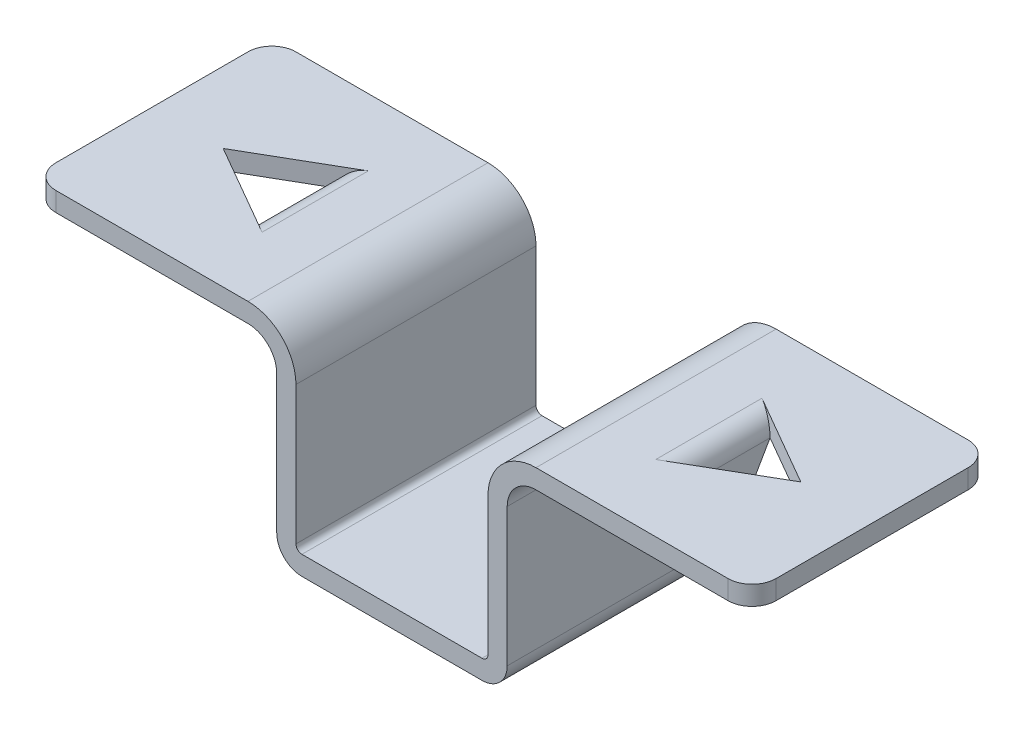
ISO-10303-21;
HEADER;
FILE_DESCRIPTION(('STEP AP214'),'2;1');
FILE_NAME('part.step','',(''),(''),'','','');
FILE_SCHEMA(('AUTOMOTIVE_DESIGN { 1 0 10303 214 1 1 1 1 }'));
ENDSEC;
DATA;
#1=APPLICATION_CONTEXT('core data for automotive mechanical design processes');
#2=APPLICATION_PROTOCOL_DEFINITION('international standard','automotive_design',2000,#1);
#3=PRODUCT_CONTEXT('',#1,'mechanical');
#4=PRODUCT('Part','Part','',(#3));
#5=PRODUCT_RELATED_PRODUCT_CATEGORY('part','',(#4));
#6=PRODUCT_DEFINITION_FORMATION('','',#4);
#7=PRODUCT_DEFINITION_CONTEXT('part definition',#1,'design');
#8=PRODUCT_DEFINITION('design','',#6,#7);
#9=PRODUCT_DEFINITION_SHAPE('','',#8);
#10=(LENGTH_UNIT() NAMED_UNIT(*) SI_UNIT(.MILLI.,.METRE.));
#11=(NAMED_UNIT(*) PLANE_ANGLE_UNIT() SI_UNIT($,.RADIAN.));
#12=(NAMED_UNIT(*) SI_UNIT($,.STERADIAN.) SOLID_ANGLE_UNIT());
#13=UNCERTAINTY_MEASURE_WITH_UNIT(LENGTH_MEASURE(1.E-05),#10,'distance_accuracy_value','');
#14=(GEOMETRIC_REPRESENTATION_CONTEXT(3) GLOBAL_UNCERTAINTY_ASSIGNED_CONTEXT((#13)) GLOBAL_UNIT_ASSIGNED_CONTEXT((#10,
#11,#12)) REPRESENTATION_CONTEXT('',''));
#15=CARTESIAN_POINT('',(0.,0.,0.));
#16=DIRECTION('',(0.,0.,1.));
#17=DIRECTION('',(1.,0.,0.));
#18=AXIS2_PLACEMENT_3D('',#15,#16,#17);
#19=CARTESIAN_POINT('',(6.00000000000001,-0.799999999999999,5.));
#20=DIRECTION('',(0.,1.,0.));
#21=DIRECTION('',(-1.,0.,0.));
#22=AXIS2_PLACEMENT_3D('',#19,#20,#21);
#23=PLANE('',#22);
#24=DIRECTION('',(0.,0.,-1.));
#25=VECTOR('',#24,1.);
#26=CARTESIAN_POINT('',(15.,-0.799999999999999,5.));
#27=LINE('',#26,#25);
#28=CARTESIAN_POINT('',(15.,-0.799999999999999,4.));
#29=VERTEX_POINT('',#28);
#30=CARTESIAN_POINT('',(15.,-0.799999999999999,-4.));
#31=VERTEX_POINT('',#30);
#32=EDGE_CURVE('E438',#29,#31,#27,.T.);
#33=ORIENTED_EDGE('',*,*,#32,.F.);
#34=CARTESIAN_POINT('',(14.,-0.799999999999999,4.));
#35=DIRECTION('',(0.,1.,0.));
#36=DIRECTION('',(-1.,0.,0.));
#37=AXIS2_PLACEMENT_3D('',#34,#35,#36);
#38=CIRCLE('',#37,1.);
#39=CARTESIAN_POINT('',(14.,-0.799999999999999,5.));
#40=VERTEX_POINT('',#39);
#41=EDGE_CURVE('E11',#29,#40,#38,.F.);
#42=ORIENTED_EDGE('',*,*,#41,.T.);
#43=DIRECTION('',(1.,0.,0.));
#44=VECTOR('',#43,1.);
#45=CARTESIAN_POINT('',(6.00000000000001,-0.799999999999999,5.));
#46=LINE('',#45,#44);
#47=CARTESIAN_POINT('',(6.00000000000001,-0.799999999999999,5.));
#48=VERTEX_POINT('',#47);
#49=EDGE_CURVE('E351',#48,#40,#46,.T.);
#50=ORIENTED_EDGE('',*,*,#49,.F.);
#51=DIRECTION('',(0.,0.,-1.));
#52=VECTOR('',#51,1.);
#53=CARTESIAN_POINT('',(6.00000000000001,-0.799999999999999,5.));
#54=LINE('',#53,#52);
#55=CARTESIAN_POINT('',(6.00000000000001,-0.799999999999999,-5.));
#56=VERTEX_POINT('',#55);
#57=EDGE_CURVE('E440',#48,#56,#54,.T.);
#58=ORIENTED_EDGE('',*,*,#57,.T.);
#59=DIRECTION('',(1.,0.,0.));
#60=VECTOR('',#59,1.);
#61=CARTESIAN_POINT('',(6.00000000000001,-0.799999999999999,-5.));
#62=LINE('',#61,#60);
#63=CARTESIAN_POINT('',(14.,-0.799999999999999,-5.));
#64=VERTEX_POINT('',#63);
#65=EDGE_CURVE('E389',#56,#64,#62,.T.);
#66=ORIENTED_EDGE('',*,*,#65,.T.);
#67=CARTESIAN_POINT('',(14.,-0.799999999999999,-4.));
#68=DIRECTION('',(0.,1.,0.));
#69=DIRECTION('',(-1.,0.,0.));
#70=AXIS2_PLACEMENT_3D('',#67,#68,#69);
#71=CIRCLE('',#70,1.);
#72=EDGE_CURVE('E40',#64,#31,#71,.F.);
#73=ORIENTED_EDGE('',*,*,#72,.T.);
#74=EDGE_LOOP('',(#33,#42,#50,#58,#66,#73));
#75=FACE_BOUND('',#74,.T.);
#76=DIRECTION('',(1.,0.,0.));
#77=VECTOR('',#76,1.);
#78=CARTESIAN_POINT('',(8.2,-0.8,-1.75));
#79=LINE('',#78,#77);
#80=CARTESIAN_POINT('',(8.2,-0.799999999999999,-1.75));
#81=VERTEX_POINT('',#80);
#82=CARTESIAN_POINT('',(9.,-0.799999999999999,-1.75));
#83=VERTEX_POINT('',#82);
#84=EDGE_CURVE('E273',#81,#83,#79,.T.);
#85=ORIENTED_EDGE('',*,*,#84,.F.);
#86=DIRECTION('',(0.,0.,-1.));
#87=VECTOR('',#86,1.);
#88=CARTESIAN_POINT('',(8.2,-0.8,1.75));
#89=LINE('',#88,#87);
#90=CARTESIAN_POINT('',(8.2,-0.799999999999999,1.75));
#91=VERTEX_POINT('',#90);
#92=EDGE_CURVE('E260',#91,#81,#89,.T.);
#93=ORIENTED_EDGE('',*,*,#92,.F.);
#94=DIRECTION('',(1.,0.,0.));
#95=VECTOR('',#94,1.);
#96=CARTESIAN_POINT('',(8.2,-0.8,1.75));
#97=LINE('',#96,#95);
#98=CARTESIAN_POINT('',(9.,-0.8,1.75));
#99=VERTEX_POINT('',#98);
#100=EDGE_CURVE('E263',#91,#99,#97,.T.);
#101=ORIENTED_EDGE('',*,*,#100,.T.);
#102=DIRECTION('',(0.866025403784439,0.,-0.5));
#103=VECTOR('',#102,1.);
#104=CARTESIAN_POINT('',(5.3427087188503,-0.799999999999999,3.86153810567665));
#105=LINE('',#104,#103);
#106=CARTESIAN_POINT('',(12.0310889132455,-0.799999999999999,0.));
#107=VERTEX_POINT('',#106);
#108=EDGE_CURVE('E317',#99,#107,#105,.T.);
#109=ORIENTED_EDGE('',*,*,#108,.T.);
#110=DIRECTION('',(-0.866025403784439,0.,-0.5));
#111=VECTOR('',#110,1.);
#112=CARTESIAN_POINT('',(9.67283573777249,-0.799999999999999,-1.36153810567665));
#113=LINE('',#112,#111);
#114=EDGE_CURVE('E314',#107,#83,#113,.T.);
#115=ORIENTED_EDGE('',*,*,#114,.T.);
#116=EDGE_LOOP('',(#85,#93,#101,#109,#115));
#117=FACE_BOUND('',#116,.T.);
#118=ADVANCED_FACE('F32',(#75,#117),#23,.F.);
#119=CARTESIAN_POINT('',(-15.,0.,5.));
#120=DIRECTION('',(1.,0.,0.));
#121=DIRECTION('',(0.,0.,-1.));
#122=AXIS2_PLACEMENT_3D('',#119,#120,#121);
#123=PLANE('',#122);
#124=DIRECTION('',(0.,0.,-1.));
#125=VECTOR('',#124,1.);
#126=CARTESIAN_POINT('',(-15.,-0.8,5.));
#127=LINE('',#126,#125);
#128=CARTESIAN_POINT('',(-15.,-0.8,4.));
#129=VERTEX_POINT('',#128);
#130=CARTESIAN_POINT('',(-15.,-0.8,-4.));
#131=VERTEX_POINT('',#130);
#132=EDGE_CURVE('E464',#129,#131,#127,.T.);
#133=ORIENTED_EDGE('',*,*,#132,.F.);
#134=DIRECTION('',(0.,-1.,0.));
#135=VECTOR('',#134,1.);
#136=CARTESIAN_POINT('',(-15.,0.,4.));
#137=LINE('',#136,#135);
#138=CARTESIAN_POINT('',(-15.,0.,4.));
#139=VERTEX_POINT('',#138);
#140=EDGE_CURVE('E502',#129,#139,#137,.F.);
#141=ORIENTED_EDGE('',*,*,#140,.T.);
#142=DIRECTION('',(0.,0.,-1.));
#143=VECTOR('',#142,1.);
#144=CARTESIAN_POINT('',(-15.,0.,5.));
#145=LINE('',#144,#143);
#146=CARTESIAN_POINT('',(-15.,0.,-4.));
#147=VERTEX_POINT('',#146);
#148=EDGE_CURVE('E373',#139,#147,#145,.T.);
#149=ORIENTED_EDGE('',*,*,#148,.T.);
#150=DIRECTION('',(0.,-1.,0.));
#151=VECTOR('',#150,1.);
#152=CARTESIAN_POINT('',(-15.,-0.8,-4.));
#153=LINE('',#152,#151);
#154=EDGE_CURVE('E499',#147,#131,#153,.T.);
#155=ORIENTED_EDGE('',*,*,#154,.T.);
#156=EDGE_LOOP('',(#133,#141,#149,#155));
#157=FACE_BOUND('',#156,.T.);
#158=ADVANCED_FACE('F552',(#157),#123,.F.);
#159=CARTESIAN_POINT('',(-15.,-0.8,5.));
#160=DIRECTION('',(0.,1.,0.));
#161=DIRECTION('',(0.,0.,1.));
#162=AXIS2_PLACEMENT_3D('',#159,#160,#161);
#163=PLANE('',#162);
#164=DIRECTION('',(0.866025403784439,0.,0.5));
#165=VECTOR('',#164,1.);
#166=CARTESIAN_POINT('',(-12.0927087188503,-0.8,-0.0355762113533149));
#167=LINE('',#166,#165);
#168=CARTESIAN_POINT('',(-12.0310889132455,-0.8,0.));
#169=VERTEX_POINT('',#168);
#170=CARTESIAN_POINT('',(-9.,-0.8,1.75));
#171=VERTEX_POINT('',#170);
#172=EDGE_CURVE('E327',#169,#171,#167,.T.);
#173=ORIENTED_EDGE('',*,*,#172,.T.);
#174=DIRECTION('',(-1.,0.,0.));
#175=VECTOR('',#174,1.);
#176=CARTESIAN_POINT('',(-8.2,-0.8,1.75));
#177=LINE('',#176,#175);
#178=CARTESIAN_POINT('',(-8.2,-0.8,1.75));
#179=VERTEX_POINT('',#178);
#180=EDGE_CURVE('E300',#179,#171,#177,.T.);
#181=ORIENTED_EDGE('',*,*,#180,.F.);
#182=DIRECTION('',(0.,0.,-1.));
#183=VECTOR('',#182,1.);
#184=CARTESIAN_POINT('',(-8.2,-0.8,1.75));
#185=LINE('',#184,#183);
#186=CARTESIAN_POINT('',(-8.2,-0.8,-1.75));
#187=VERTEX_POINT('',#186);
#188=EDGE_CURVE('E286',#179,#187,#185,.T.);
#189=ORIENTED_EDGE('',*,*,#188,.T.);
#190=DIRECTION('',(-1.,0.,0.));
#191=VECTOR('',#190,1.);
#192=CARTESIAN_POINT('',(-8.2,-0.8,-1.75));
#193=LINE('',#192,#191);
#194=CARTESIAN_POINT('',(-9.,-0.8,-1.75));
#195=VERTEX_POINT('',#194);
#196=EDGE_CURVE('E295',#187,#195,#193,.T.);
#197=ORIENTED_EDGE('',*,*,#196,.T.);
#198=DIRECTION('',(-0.866025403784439,0.,0.5));
#199=VECTOR('',#198,1.);
#200=CARTESIAN_POINT('',(-16.4228357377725,-0.8,2.53557621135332));
#201=LINE('',#200,#199);
#202=EDGE_CURVE('E330',#195,#169,#201,.T.);
#203=ORIENTED_EDGE('',*,*,#202,.T.);
#204=EDGE_LOOP('',(#173,#181,#189,#197,#203));
#205=FACE_BOUND('',#204,.T.);
#206=DIRECTION('',(1.,0.,0.));
#207=VECTOR('',#206,1.);
#208=CARTESIAN_POINT('',(-15.,-0.8,5.));
#209=LINE('',#208,#207);
#210=CARTESIAN_POINT('',(-14.,-0.8,5.));
#211=VERTEX_POINT('',#210);
#212=CARTESIAN_POINT('',(-6.00000000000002,-0.8,5.));
#213=VERTEX_POINT('',#212);
#214=EDGE_CURVE('E334',#211,#213,#209,.T.);
#215=ORIENTED_EDGE('',*,*,#214,.F.);
#216=CARTESIAN_POINT('',(-14.,-0.8,4.));
#217=DIRECTION('',(0.,1.,0.));
#218=DIRECTION('',(0.,0.,1.));
#219=AXIS2_PLACEMENT_3D('',#216,#217,#218);
#220=CIRCLE('',#219,1.);
#221=EDGE_CURVE('E497',#211,#129,#220,.F.);
#222=ORIENTED_EDGE('',*,*,#221,.T.);
#223=ORIENTED_EDGE('',*,*,#132,.T.);
#224=CARTESIAN_POINT('',(-14.,-0.8,-4.));
#225=DIRECTION('',(0.,1.,0.));
#226=DIRECTION('',(0.,0.,1.));
#227=AXIS2_PLACEMENT_3D('',#224,#225,#226);
#228=CIRCLE('',#227,1.);
#229=CARTESIAN_POINT('',(-14.,-0.8,-5.));
#230=VERTEX_POINT('',#229);
#231=EDGE_CURVE('E495',#131,#230,#228,.F.);
#232=ORIENTED_EDGE('',*,*,#231,.T.);
#233=DIRECTION('',(1.,0.,0.));
#234=VECTOR('',#233,1.);
#235=CARTESIAN_POINT('',(-15.,-0.8,-5.));
#236=LINE('',#235,#234);
#237=CARTESIAN_POINT('',(-6.00000000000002,-0.8,-5.));
#238=VERTEX_POINT('',#237);
#239=EDGE_CURVE('E333',#230,#238,#236,.T.);
#240=ORIENTED_EDGE('',*,*,#239,.T.);
#241=DIRECTION('',(0.,0.,-1.));
#242=VECTOR('',#241,1.);
#243=CARTESIAN_POINT('',(-6.00000000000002,-0.8,5.));
#244=LINE('',#243,#242);
#245=EDGE_CURVE('E461',#213,#238,#244,.T.);
#246=ORIENTED_EDGE('',*,*,#245,.F.);
#247=EDGE_LOOP('',(#215,#222,#223,#232,#240,#246));
#248=FACE_BOUND('',#247,.T.);
#249=ADVANCED_FACE('F557',(#205,#248),#163,.F.);
#250=CARTESIAN_POINT('',(-6.,-2.,5.));
#251=DIRECTION('',(0.,0.,-1.));
#252=DIRECTION('',(-1.,0.,0.));
#253=AXIS2_PLACEMENT_3D('',#250,#251,#252);
#254=CYLINDRICAL_SURFACE('',#253,1.2);
#255=CARTESIAN_POINT('',(-6.,-2.,-5.));
#256=DIRECTION('',(0.,0.,-1.));
#257=DIRECTION('',(-1.,0.,0.));
#258=AXIS2_PLACEMENT_3D('',#255,#256,#257);
#259=CIRCLE('',#258,1.2);
#260=CARTESIAN_POINT('',(-4.8,-2.00000000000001,-5.));
#261=VERTEX_POINT('',#260);
#262=EDGE_CURVE('E375',#238,#261,#259,.T.);
#263=ORIENTED_EDGE('',*,*,#262,.T.);
#264=DIRECTION('',(0.,0.,-1.));
#265=VECTOR('',#264,1.);
#266=CARTESIAN_POINT('',(-4.8,-2.00000000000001,5.));
#267=LINE('',#266,#265);
#268=CARTESIAN_POINT('',(-4.8,-2.00000000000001,5.));
#269=VERTEX_POINT('',#268);
#270=EDGE_CURVE('E458',#269,#261,#267,.T.);
#271=ORIENTED_EDGE('',*,*,#270,.F.);
#272=CARTESIAN_POINT('',(-6.,-2.,5.));
#273=DIRECTION('',(0.,0.,-1.));
#274=DIRECTION('',(-1.,0.,0.));
#275=AXIS2_PLACEMENT_3D('',#272,#273,#274);
#276=CIRCLE('',#275,1.2);
#277=EDGE_CURVE('E336',#213,#269,#276,.T.);
#278=ORIENTED_EDGE('',*,*,#277,.F.);
#279=ORIENTED_EDGE('',*,*,#245,.T.);
#280=EDGE_LOOP('',(#263,#271,#278,#279));
#281=FACE_BOUND('',#280,.T.);
#282=ADVANCED_FACE('F585',(#281),#254,.F.);
#283=CARTESIAN_POINT('',(-4.8,-2.00000000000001,5.));
#284=DIRECTION('',(1.,0.,0.));
#285=DIRECTION('',(0.,1.,0.));
#286=AXIS2_PLACEMENT_3D('',#283,#284,#285);
#287=PLANE('',#286);
#288=DIRECTION('',(0.,-1.,0.));
#289=VECTOR('',#288,1.);
#290=CARTESIAN_POINT('',(-4.8,-2.00000000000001,-5.));
#291=LINE('',#290,#289);
#292=CARTESIAN_POINT('',(-4.8,-7.75,-5.));
#293=VERTEX_POINT('',#292);
#294=EDGE_CURVE('E377',#261,#293,#291,.T.);
#295=ORIENTED_EDGE('',*,*,#294,.T.);
#296=DIRECTION('',(0.,0.,-1.));
#297=VECTOR('',#296,1.);
#298=CARTESIAN_POINT('',(-4.8,-7.75,5.));
#299=LINE('',#298,#297);
#300=CARTESIAN_POINT('',(-4.8,-7.75,5.));
#301=VERTEX_POINT('',#300);
#302=EDGE_CURVE('E455',#301,#293,#299,.T.);
#303=ORIENTED_EDGE('',*,*,#302,.F.);
#304=DIRECTION('',(0.,-1.,0.));
#305=VECTOR('',#304,1.);
#306=CARTESIAN_POINT('',(-4.8,-2.00000000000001,5.));
#307=LINE('',#306,#305);
#308=EDGE_CURVE('E339',#269,#301,#307,.T.);
#309=ORIENTED_EDGE('',*,*,#308,.F.);
#310=ORIENTED_EDGE('',*,*,#270,.T.);
#311=EDGE_LOOP('',(#295,#303,#309,#310));
#312=FACE_BOUND('',#311,.T.);
#313=ADVANCED_FACE('F581',(#312),#287,.F.);
#314=CARTESIAN_POINT('',(-3.75,-7.75,5.));
#315=DIRECTION('',(0.,0.,-1.));
#316=DIRECTION('',(-1.,0.,0.));
#317=AXIS2_PLACEMENT_3D('',#314,#315,#316);
#318=CYLINDRICAL_SURFACE('',#317,1.05);
#319=CARTESIAN_POINT('',(-3.75,-7.75,-5.));
#320=DIRECTION('',(0.,0.,1.));
#321=DIRECTION('',(1.,0.,0.));
#322=AXIS2_PLACEMENT_3D('',#319,#320,#321);
#323=CIRCLE('',#322,1.05);
#324=CARTESIAN_POINT('',(-3.74999999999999,-8.8,-5.));
#325=VERTEX_POINT('',#324);
#326=EDGE_CURVE('E379',#293,#325,#323,.T.);
#327=ORIENTED_EDGE('',*,*,#326,.T.);
#328=DIRECTION('',(0.,0.,-1.));
#329=VECTOR('',#328,1.);
#330=CARTESIAN_POINT('',(-3.74999999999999,-8.8,5.));
#331=LINE('',#330,#329);
#332=CARTESIAN_POINT('',(-3.74999999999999,-8.8,5.));
#333=VERTEX_POINT('',#332);
#334=EDGE_CURVE('E452',#333,#325,#331,.T.);
#335=ORIENTED_EDGE('',*,*,#334,.F.);
#336=CARTESIAN_POINT('',(-3.75,-7.75,5.));
#337=DIRECTION('',(0.,0.,1.));
#338=DIRECTION('',(1.,0.,0.));
#339=AXIS2_PLACEMENT_3D('',#336,#337,#338);
#340=CIRCLE('',#339,1.05);
#341=EDGE_CURVE('E341',#301,#333,#340,.T.);
#342=ORIENTED_EDGE('',*,*,#341,.F.);
#343=ORIENTED_EDGE('',*,*,#302,.T.);
#344=EDGE_LOOP('',(#327,#335,#342,#343));
#345=FACE_BOUND('',#344,.T.);
#346=ADVANCED_FACE('F577',(#345),#318,.T.);
#347=CARTESIAN_POINT('',(-3.74999999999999,-8.8,5.));
#348=DIRECTION('',(0.,1.,0.));
#349=DIRECTION('',(0.,0.,1.));
#350=AXIS2_PLACEMENT_3D('',#347,#348,#349);
#351=PLANE('',#350);
#352=DIRECTION('',(1.,0.,0.));
#353=VECTOR('',#352,1.);
#354=CARTESIAN_POINT('',(-3.74999999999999,-8.8,-5.));
#355=LINE('',#354,#353);
#356=CARTESIAN_POINT('',(3.75,-8.8,-5.));
#357=VERTEX_POINT('',#356);
#358=EDGE_CURVE('E381',#325,#357,#355,.T.);
#359=ORIENTED_EDGE('',*,*,#358,.T.);
#360=DIRECTION('',(0.,0.,-1.));
#361=VECTOR('',#360,1.);
#362=CARTESIAN_POINT('',(3.75,-8.8,5.));
#363=LINE('',#362,#361);
#364=CARTESIAN_POINT('',(3.75,-8.8,5.));
#365=VERTEX_POINT('',#364);
#366=EDGE_CURVE('E449',#365,#357,#363,.T.);
#367=ORIENTED_EDGE('',*,*,#366,.F.);
#368=DIRECTION('',(1.,0.,0.));
#369=VECTOR('',#368,1.);
#370=CARTESIAN_POINT('',(-3.74999999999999,-8.8,5.));
#371=LINE('',#370,#369);
#372=EDGE_CURVE('E343',#333,#365,#371,.T.);
#373=ORIENTED_EDGE('',*,*,#372,.F.);
#374=ORIENTED_EDGE('',*,*,#334,.T.);
#375=EDGE_LOOP('',(#359,#367,#373,#374));
#376=FACE_BOUND('',#375,.T.);
#377=ADVANCED_FACE('F573',(#376),#351,.F.);
#378=CARTESIAN_POINT('',(3.75,-7.75,5.));
#379=DIRECTION('',(0.,0.,-1.));
#380=DIRECTION('',(-1.,0.,0.));
#381=AXIS2_PLACEMENT_3D('',#378,#379,#380);
#382=CYLINDRICAL_SURFACE('',#381,1.05);
#383=CARTESIAN_POINT('',(3.75,-7.75,-5.));
#384=DIRECTION('',(0.,0.,1.));
#385=DIRECTION('',(1.,0.,0.));
#386=AXIS2_PLACEMENT_3D('',#383,#384,#385);
#387=CIRCLE('',#386,1.05);
#388=CARTESIAN_POINT('',(4.8,-7.74999999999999,-5.));
#389=VERTEX_POINT('',#388);
#390=EDGE_CURVE('E383',#357,#389,#387,.T.);
#391=ORIENTED_EDGE('',*,*,#390,.T.);
#392=DIRECTION('',(0.,0.,-1.));
#393=VECTOR('',#392,1.);
#394=CARTESIAN_POINT('',(4.8,-7.74999999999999,5.));
#395=LINE('',#394,#393);
#396=CARTESIAN_POINT('',(4.8,-7.74999999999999,5.));
#397=VERTEX_POINT('',#396);
#398=EDGE_CURVE('E446',#397,#389,#395,.T.);
#399=ORIENTED_EDGE('',*,*,#398,.F.);
#400=CARTESIAN_POINT('',(3.75,-7.75,5.));
#401=DIRECTION('',(0.,0.,1.));
#402=DIRECTION('',(1.,0.,0.));
#403=AXIS2_PLACEMENT_3D('',#400,#401,#402);
#404=CIRCLE('',#403,1.05);
#405=EDGE_CURVE('E345',#365,#397,#404,.T.);
#406=ORIENTED_EDGE('',*,*,#405,.F.);
#407=ORIENTED_EDGE('',*,*,#366,.T.);
#408=EDGE_LOOP('',(#391,#399,#406,#407));
#409=FACE_BOUND('',#408,.T.);
#410=ADVANCED_FACE('F569',(#409),#382,.T.);
#411=CARTESIAN_POINT('',(4.8,-7.74999999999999,5.));
#412=DIRECTION('',(-1.,0.,0.));
#413=DIRECTION('',(0.,0.,1.));
#414=AXIS2_PLACEMENT_3D('',#411,#412,#413);
#415=PLANE('',#414);
#416=DIRECTION('',(0.,1.,0.));
#417=VECTOR('',#416,1.);
#418=CARTESIAN_POINT('',(4.8,-7.74999999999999,-5.));
#419=LINE('',#418,#417);
#420=CARTESIAN_POINT('',(4.8,-2.00000000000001,-5.));
#421=VERTEX_POINT('',#420);
#422=EDGE_CURVE('E385',#389,#421,#419,.T.);
#423=ORIENTED_EDGE('',*,*,#422,.T.);
#424=DIRECTION('',(0.,0.,-1.));
#425=VECTOR('',#424,1.);
#426=CARTESIAN_POINT('',(4.8,-2.00000000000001,5.));
#427=LINE('',#426,#425);
#428=CARTESIAN_POINT('',(4.8,-2.00000000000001,5.));
#429=VERTEX_POINT('',#428);
#430=EDGE_CURVE('E443',#429,#421,#427,.T.);
#431=ORIENTED_EDGE('',*,*,#430,.F.);
#432=DIRECTION('',(0.,1.,0.));
#433=VECTOR('',#432,1.);
#434=CARTESIAN_POINT('',(4.8,-7.74999999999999,5.));
#435=LINE('',#434,#433);
#436=EDGE_CURVE('E347',#397,#429,#435,.T.);
#437=ORIENTED_EDGE('',*,*,#436,.F.);
#438=ORIENTED_EDGE('',*,*,#398,.T.);
#439=EDGE_LOOP('',(#423,#431,#437,#438));
#440=FACE_BOUND('',#439,.T.);
#441=ADVANCED_FACE('F566',(#440),#415,.F.);
#442=CARTESIAN_POINT('',(6.,-2.,5.));
#443=DIRECTION('',(0.,0.,-1.));
#444=DIRECTION('',(-1.,0.,0.));
#445=AXIS2_PLACEMENT_3D('',#442,#443,#444);
#446=CYLINDRICAL_SURFACE('',#445,1.2);
#447=CARTESIAN_POINT('',(6.,-2.,-5.));
#448=DIRECTION('',(0.,0.,-1.));
#449=DIRECTION('',(-1.,0.,0.));
#450=AXIS2_PLACEMENT_3D('',#447,#448,#449);
#451=CIRCLE('',#450,1.2);
#452=EDGE_CURVE('E387',#421,#56,#451,.T.);
#453=ORIENTED_EDGE('',*,*,#452,.T.);
#454=ORIENTED_EDGE('',*,*,#57,.F.);
#455=CARTESIAN_POINT('',(6.,-2.,5.));
#456=DIRECTION('',(0.,0.,-1.));
#457=DIRECTION('',(-1.,0.,0.));
#458=AXIS2_PLACEMENT_3D('',#455,#456,#457);
#459=CIRCLE('',#458,1.2);
#460=EDGE_CURVE('E349',#429,#48,#459,.T.);
#461=ORIENTED_EDGE('',*,*,#460,.F.);
#462=ORIENTED_EDGE('',*,*,#430,.T.);
#463=EDGE_LOOP('',(#453,#454,#461,#462));
#464=FACE_BOUND('',#463,.T.);
#465=ADVANCED_FACE('F563',(#464),#446,.F.);
#466=CARTESIAN_POINT('',(15.,0.,5.));
#467=DIRECTION('',(-1.,0.,0.));
#468=DIRECTION('',(0.,0.,1.));
#469=AXIS2_PLACEMENT_3D('',#466,#467,#468);
#470=PLANE('',#469);
#471=DIRECTION('',(0.,0.,-1.));
#472=VECTOR('',#471,1.);
#473=CARTESIAN_POINT('',(15.,0.,5.));
#474=LINE('',#473,#472);
#475=CARTESIAN_POINT('',(15.,0.,4.));
#476=VERTEX_POINT('',#475);
#477=CARTESIAN_POINT('',(15.,0.,-4.));
#478=VERTEX_POINT('',#477);
#479=EDGE_CURVE('E435',#476,#478,#474,.T.);
#480=ORIENTED_EDGE('',*,*,#479,.F.);
#481=DIRECTION('',(0.,1.,0.));
#482=VECTOR('',#481,1.);
#483=CARTESIAN_POINT('',(15.,0.,4.));
#484=LINE('',#483,#482);
#485=EDGE_CURVE('E53',#476,#29,#484,.F.);
#486=ORIENTED_EDGE('',*,*,#485,.T.);
#487=ORIENTED_EDGE('',*,*,#32,.T.);
#488=DIRECTION('',(0.,1.,0.));
#489=VECTOR('',#488,1.);
#490=CARTESIAN_POINT('',(15.,0.,-4.));
#491=LINE('',#490,#489);
#492=EDGE_CURVE('E516',#31,#478,#491,.T.);
#493=ORIENTED_EDGE('',*,*,#492,.T.);
#494=EDGE_LOOP('',(#480,#486,#487,#493));
#495=FACE_BOUND('',#494,.T.);
#496=ADVANCED_FACE('F520',(#495),#470,.F.);
#497=CARTESIAN_POINT('',(6.00000000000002,0.,5.));
#498=DIRECTION('',(0.,-1.,0.));
#499=DIRECTION('',(1.,0.,0.));
#500=AXIS2_PLACEMENT_3D('',#497,#498,#499);
#501=PLANE('',#500);
#502=DIRECTION('',(0.866025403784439,0.,-0.5));
#503=VECTOR('',#502,1.);
#504=CARTESIAN_POINT('',(9.,0.,1.75));
#505=LINE('',#504,#503);
#506=CARTESIAN_POINT('',(8.2,0.,2.2118802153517));
#507=VERTEX_POINT('',#506);
#508=CARTESIAN_POINT('',(12.0310889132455,0.,0.));
#509=VERTEX_POINT('',#508);
#510=EDGE_CURVE('E303',#507,#509,#505,.T.);
#511=ORIENTED_EDGE('',*,*,#510,.F.);
#512=DIRECTION('',(0.,0.,1.));
#513=VECTOR('',#512,1.);
#514=CARTESIAN_POINT('',(8.2,0.,5.));
#515=LINE('',#514,#513);
#516=CARTESIAN_POINT('',(8.2,0.,-2.2118802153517));
#517=VERTEX_POINT('',#516);
#518=EDGE_CURVE('E470',#507,#517,#515,.F.);
#519=ORIENTED_EDGE('',*,*,#518,.T.);
#520=DIRECTION('',(-0.866025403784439,0.,-0.5));
#521=VECTOR('',#520,1.);
#522=CARTESIAN_POINT('',(12.0310889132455,0.,0.));
#523=LINE('',#522,#521);
#524=EDGE_CURVE('E309',#509,#517,#523,.T.);
#525=ORIENTED_EDGE('',*,*,#524,.F.);
#526=EDGE_LOOP('',(#511,#519,#525));
#527=FACE_BOUND('',#526,.T.);
#528=DIRECTION('',(-1.,0.,0.));
#529=VECTOR('',#528,1.);
#530=CARTESIAN_POINT('',(6.00000000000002,0.,5.));
#531=LINE('',#530,#529);
#532=CARTESIAN_POINT('',(14.,0.,5.));
#533=VERTEX_POINT('',#532);
#534=CARTESIAN_POINT('',(6.00000000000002,0.,5.));
#535=VERTEX_POINT('',#534);
#536=EDGE_CURVE('E354',#533,#535,#531,.T.);
#537=ORIENTED_EDGE('',*,*,#536,.F.);
#538=CARTESIAN_POINT('',(14.,0.,4.));
#539=DIRECTION('',(0.,-1.,0.));
#540=DIRECTION('',(1.,0.,0.));
#541=AXIS2_PLACEMENT_3D('',#538,#539,#540);
#542=CIRCLE('',#541,1.);
#543=EDGE_CURVE('E514',#533,#476,#542,.F.);
#544=ORIENTED_EDGE('',*,*,#543,.T.);
#545=ORIENTED_EDGE('',*,*,#479,.T.);
#546=CARTESIAN_POINT('',(14.,0.,-4.));
#547=DIRECTION('',(0.,-1.,0.));
#548=DIRECTION('',(1.,0.,0.));
#549=AXIS2_PLACEMENT_3D('',#546,#547,#548);
#550=CIRCLE('',#549,1.);
#551=CARTESIAN_POINT('',(14.,0.,-5.));
#552=VERTEX_POINT('',#551);
#553=EDGE_CURVE('E512',#478,#552,#550,.F.);
#554=ORIENTED_EDGE('',*,*,#553,.T.);
#555=DIRECTION('',(-1.,0.,0.));
#556=VECTOR('',#555,1.);
#557=CARTESIAN_POINT('',(6.00000000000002,0.,-5.));
#558=LINE('',#557,#556);
#559=CARTESIAN_POINT('',(6.00000000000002,0.,-5.));
#560=VERTEX_POINT('',#559);
#561=EDGE_CURVE('E391',#552,#560,#558,.T.);
#562=ORIENTED_EDGE('',*,*,#561,.T.);
#563=DIRECTION('',(0.,0.,-1.));
#564=VECTOR('',#563,1.);
#565=CARTESIAN_POINT('',(6.00000000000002,0.,5.));
#566=LINE('',#565,#564);
#567=EDGE_CURVE('E432',#535,#560,#566,.T.);
#568=ORIENTED_EDGE('',*,*,#567,.F.);
#569=EDGE_LOOP('',(#537,#544,#545,#554,#562,#568));
#570=FACE_BOUND('',#569,.T.);
#571=ADVANCED_FACE('F524',(#527,#570),#501,.F.);
#572=CARTESIAN_POINT('',(6.,-2.,5.));
#573=DIRECTION('',(0.,0.,-1.));
#574=DIRECTION('',(-1.,0.,0.));
#575=AXIS2_PLACEMENT_3D('',#572,#573,#574);
#576=CYLINDRICAL_SURFACE('',#575,2.);
#577=CARTESIAN_POINT('',(6.,-2.,-5.));
#578=DIRECTION('',(0.,0.,1.));
#579=DIRECTION('',(-1.,0.,0.));
#580=AXIS2_PLACEMENT_3D('',#577,#578,#579);
#581=CIRCLE('',#580,2.);
#582=CARTESIAN_POINT('',(4.,-2.00000000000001,-5.));
#583=VERTEX_POINT('',#582);
#584=EDGE_CURVE('E393',#560,#583,#581,.T.);
#585=ORIENTED_EDGE('',*,*,#584,.T.);
#586=DIRECTION('',(0.,0.,-1.));
#587=VECTOR('',#586,1.);
#588=CARTESIAN_POINT('',(4.,-2.00000000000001,5.));
#589=LINE('',#588,#587);
#590=CARTESIAN_POINT('',(4.,-2.00000000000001,5.));
#591=VERTEX_POINT('',#590);
#592=EDGE_CURVE('E429',#591,#583,#589,.T.);
#593=ORIENTED_EDGE('',*,*,#592,.F.);
#594=CARTESIAN_POINT('',(6.,-2.,5.));
#595=DIRECTION('',(0.,0.,1.));
#596=DIRECTION('',(-1.,0.,0.));
#597=AXIS2_PLACEMENT_3D('',#594,#595,#596);
#598=CIRCLE('',#597,2.);
#599=EDGE_CURVE('E356',#535,#591,#598,.T.);
#600=ORIENTED_EDGE('',*,*,#599,.F.);
#601=ORIENTED_EDGE('',*,*,#567,.T.);
#602=EDGE_LOOP('',(#585,#593,#600,#601));
#603=FACE_BOUND('',#602,.T.);
#604=ADVANCED_FACE('F674',(#603),#576,.T.);
#605=CARTESIAN_POINT('',(4.,-7.75,5.));
#606=DIRECTION('',(1.,0.,0.));
#607=DIRECTION('',(0.,1.,0.));
#608=AXIS2_PLACEMENT_3D('',#605,#606,#607);
#609=PLANE('',#608);
#610=DIRECTION('',(0.,-1.,0.));
#611=VECTOR('',#610,1.);
#612=CARTESIAN_POINT('',(4.,-7.75,-5.));
#613=LINE('',#612,#611);
#614=CARTESIAN_POINT('',(4.,-7.75,-5.));
#615=VERTEX_POINT('',#614);
#616=EDGE_CURVE('E395',#583,#615,#613,.T.);
#617=ORIENTED_EDGE('',*,*,#616,.T.);
#618=DIRECTION('',(0.,0.,-1.));
#619=VECTOR('',#618,1.);
#620=CARTESIAN_POINT('',(4.,-7.75,5.));
#621=LINE('',#620,#619);
#622=CARTESIAN_POINT('',(4.,-7.75,5.));
#623=VERTEX_POINT('',#622);
#624=EDGE_CURVE('E426',#623,#615,#621,.T.);
#625=ORIENTED_EDGE('',*,*,#624,.F.);
#626=DIRECTION('',(0.,-1.,0.));
#627=VECTOR('',#626,1.);
#628=CARTESIAN_POINT('',(4.,-7.75,5.));
#629=LINE('',#628,#627);
#630=EDGE_CURVE('E358',#591,#623,#629,.T.);
#631=ORIENTED_EDGE('',*,*,#630,.F.);
#632=ORIENTED_EDGE('',*,*,#592,.T.);
#633=EDGE_LOOP('',(#617,#625,#631,#632));
#634=FACE_BOUND('',#633,.T.);
#635=ADVANCED_FACE('F670',(#634),#609,.F.);
#636=CARTESIAN_POINT('',(3.75,-7.75,5.));
#637=DIRECTION('',(0.,0.,-1.));
#638=DIRECTION('',(-1.,0.,0.));
#639=AXIS2_PLACEMENT_3D('',#636,#637,#638);
#640=CYLINDRICAL_SURFACE('',#639,0.25);
#641=CARTESIAN_POINT('',(3.75,-7.75,-5.));
#642=DIRECTION('',(0.,0.,-1.));
#643=DIRECTION('',(1.,0.,0.));
#644=AXIS2_PLACEMENT_3D('',#641,#642,#643);
#645=CIRCLE('',#644,0.25);
#646=CARTESIAN_POINT('',(3.75,-8.,-5.));
#647=VERTEX_POINT('',#646);
#648=EDGE_CURVE('E397',#615,#647,#645,.T.);
#649=ORIENTED_EDGE('',*,*,#648,.T.);
#650=DIRECTION('',(0.,0.,-1.));
#651=VECTOR('',#650,1.);
#652=CARTESIAN_POINT('',(3.75,-8.,5.));
#653=LINE('',#652,#651);
#654=CARTESIAN_POINT('',(3.75,-8.,5.));
#655=VERTEX_POINT('',#654);
#656=EDGE_CURVE('E423',#655,#647,#653,.T.);
#657=ORIENTED_EDGE('',*,*,#656,.F.);
#658=CARTESIAN_POINT('',(3.75,-7.75,5.));
#659=DIRECTION('',(0.,0.,-1.));
#660=DIRECTION('',(1.,0.,0.));
#661=AXIS2_PLACEMENT_3D('',#658,#659,#660);
#662=CIRCLE('',#661,0.25);
#663=EDGE_CURVE('E360',#623,#655,#662,.T.);
#664=ORIENTED_EDGE('',*,*,#663,.F.);
#665=ORIENTED_EDGE('',*,*,#624,.T.);
#666=EDGE_LOOP('',(#649,#657,#664,#665));
#667=FACE_BOUND('',#666,.T.);
#668=ADVANCED_FACE('F665',(#667),#640,.F.);
#669=CARTESIAN_POINT('',(-3.75,-8.,5.));
#670=DIRECTION('',(0.,-1.,0.));
#671=DIRECTION('',(0.,0.,-1.));
#672=AXIS2_PLACEMENT_3D('',#669,#670,#671);
#673=PLANE('',#672);
#674=DIRECTION('',(-1.,0.,0.));
#675=VECTOR('',#674,1.);
#676=CARTESIAN_POINT('',(-3.75,-8.,-5.));
#677=LINE('',#676,#675);
#678=CARTESIAN_POINT('',(-3.75,-8.,-5.));
#679=VERTEX_POINT('',#678);
#680=EDGE_CURVE('E399',#647,#679,#677,.T.);
#681=ORIENTED_EDGE('',*,*,#680,.T.);
#682=DIRECTION('',(0.,0.,-1.));
#683=VECTOR('',#682,1.);
#684=CARTESIAN_POINT('',(-3.75,-8.,5.));
#685=LINE('',#684,#683);
#686=CARTESIAN_POINT('',(-3.75,-8.,5.));
#687=VERTEX_POINT('',#686);
#688=EDGE_CURVE('E420',#687,#679,#685,.T.);
#689=ORIENTED_EDGE('',*,*,#688,.F.);
#690=DIRECTION('',(-1.,0.,0.));
#691=VECTOR('',#690,1.);
#692=CARTESIAN_POINT('',(-3.75,-8.,5.));
#693=LINE('',#692,#691);
#694=EDGE_CURVE('E362',#655,#687,#693,.T.);
#695=ORIENTED_EDGE('',*,*,#694,.F.);
#696=ORIENTED_EDGE('',*,*,#656,.T.);
#697=EDGE_LOOP('',(#681,#689,#695,#696));
#698=FACE_BOUND('',#697,.T.);
#699=ADVANCED_FACE('F660',(#698),#673,.F.);
#700=CARTESIAN_POINT('',(-3.75,-7.75,5.));
#701=DIRECTION('',(0.,0.,-1.));
#702=DIRECTION('',(-1.,0.,0.));
#703=AXIS2_PLACEMENT_3D('',#700,#701,#702);
#704=CYLINDRICAL_SURFACE('',#703,0.25);
#705=CARTESIAN_POINT('',(-3.75,-7.75,-5.));
#706=DIRECTION('',(0.,0.,-1.));
#707=DIRECTION('',(1.,0.,0.));
#708=AXIS2_PLACEMENT_3D('',#705,#706,#707);
#709=CIRCLE('',#708,0.25);
#710=CARTESIAN_POINT('',(-4.,-7.75,-5.));
#711=VERTEX_POINT('',#710);
#712=EDGE_CURVE('E401',#679,#711,#709,.T.);
#713=ORIENTED_EDGE('',*,*,#712,.T.);
#714=DIRECTION('',(0.,0.,-1.));
#715=VECTOR('',#714,1.);
#716=CARTESIAN_POINT('',(-4.,-7.75,5.));
#717=LINE('',#716,#715);
#718=CARTESIAN_POINT('',(-4.,-7.75,5.));
#719=VERTEX_POINT('',#718);
#720=EDGE_CURVE('E417',#719,#711,#717,.T.);
#721=ORIENTED_EDGE('',*,*,#720,.F.);
#722=CARTESIAN_POINT('',(-3.75,-7.75,5.));
#723=DIRECTION('',(0.,0.,-1.));
#724=DIRECTION('',(1.,0.,0.));
#725=AXIS2_PLACEMENT_3D('',#722,#723,#724);
#726=CIRCLE('',#725,0.25);
#727=EDGE_CURVE('E364',#687,#719,#726,.T.);
#728=ORIENTED_EDGE('',*,*,#727,.F.);
#729=ORIENTED_EDGE('',*,*,#688,.T.);
#730=EDGE_LOOP('',(#713,#721,#728,#729));
#731=FACE_BOUND('',#730,.T.);
#732=ADVANCED_FACE('F656',(#731),#704,.F.);
#733=CARTESIAN_POINT('',(-4.,-2.00000000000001,5.));
#734=DIRECTION('',(-1.,0.,0.));
#735=DIRECTION('',(0.,-1.,0.));
#736=AXIS2_PLACEMENT_3D('',#733,#734,#735);
#737=PLANE('',#736);
#738=DIRECTION('',(0.,1.,0.));
#739=VECTOR('',#738,1.);
#740=CARTESIAN_POINT('',(-4.,-2.00000000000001,-5.));
#741=LINE('',#740,#739);
#742=CARTESIAN_POINT('',(-4.,-2.00000000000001,-5.));
#743=VERTEX_POINT('',#742);
#744=EDGE_CURVE('E403',#711,#743,#741,.T.);
#745=ORIENTED_EDGE('',*,*,#744,.T.);
#746=DIRECTION('',(0.,0.,-1.));
#747=VECTOR('',#746,1.);
#748=CARTESIAN_POINT('',(-4.,-2.00000000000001,5.));
#749=LINE('',#748,#747);
#750=CARTESIAN_POINT('',(-4.,-2.00000000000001,5.));
#751=VERTEX_POINT('',#750);
#752=EDGE_CURVE('E414',#751,#743,#749,.T.);
#753=ORIENTED_EDGE('',*,*,#752,.F.);
#754=DIRECTION('',(0.,1.,0.));
#755=VECTOR('',#754,1.);
#756=CARTESIAN_POINT('',(-4.,-2.00000000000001,5.));
#757=LINE('',#756,#755);
#758=EDGE_CURVE('E366',#719,#751,#757,.T.);
#759=ORIENTED_EDGE('',*,*,#758,.F.);
#760=ORIENTED_EDGE('',*,*,#720,.T.);
#761=EDGE_LOOP('',(#745,#753,#759,#760));
#762=FACE_BOUND('',#761,.T.);
#763=ADVANCED_FACE('F652',(#762),#737,.F.);
#764=CARTESIAN_POINT('',(-6.,-2.,5.));
#765=DIRECTION('',(0.,0.,-1.));
#766=DIRECTION('',(-1.,0.,0.));
#767=AXIS2_PLACEMENT_3D('',#764,#765,#766);
#768=CYLINDRICAL_SURFACE('',#767,2.);
#769=CARTESIAN_POINT('',(-6.,-2.,-5.));
#770=DIRECTION('',(0.,0.,1.));
#771=DIRECTION('',(-1.,0.,0.));
#772=AXIS2_PLACEMENT_3D('',#769,#770,#771);
#773=CIRCLE('',#772,2.);
#774=CARTESIAN_POINT('',(-6.00000000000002,0.,-5.));
#775=VERTEX_POINT('',#774);
#776=EDGE_CURVE('E405',#743,#775,#773,.T.);
#777=ORIENTED_EDGE('',*,*,#776,.T.);
#778=DIRECTION('',(0.,0.,-1.));
#779=VECTOR('',#778,1.);
#780=CARTESIAN_POINT('',(-6.00000000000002,0.,5.));
#781=LINE('',#780,#779);
#782=CARTESIAN_POINT('',(-6.00000000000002,0.,5.));
#783=VERTEX_POINT('',#782);
#784=EDGE_CURVE('E411',#783,#775,#781,.T.);
#785=ORIENTED_EDGE('',*,*,#784,.F.);
#786=CARTESIAN_POINT('',(-6.,-2.,5.));
#787=DIRECTION('',(0.,0.,1.));
#788=DIRECTION('',(-1.,0.,0.));
#789=AXIS2_PLACEMENT_3D('',#786,#787,#788);
#790=CIRCLE('',#789,2.);
#791=EDGE_CURVE('E368',#751,#783,#790,.T.);
#792=ORIENTED_EDGE('',*,*,#791,.F.);
#793=ORIENTED_EDGE('',*,*,#752,.T.);
#794=EDGE_LOOP('',(#777,#785,#792,#793));
#795=FACE_BOUND('',#794,.T.);
#796=ADVANCED_FACE('F627',(#795),#768,.T.);
#797=CARTESIAN_POINT('',(-15.,0.,5.));
#798=DIRECTION('',(0.,-1.,0.));
#799=DIRECTION('',(1.,0.,0.));
#800=AXIS2_PLACEMENT_3D('',#797,#798,#799);
#801=PLANE('',#800);
#802=DIRECTION('',(-0.866025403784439,0.,0.5));
#803=VECTOR('',#802,1.);
#804=CARTESIAN_POINT('',(-12.0310889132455,0.,0.));
#805=LINE('',#804,#803);
#806=CARTESIAN_POINT('',(-8.2,0.,-2.2118802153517));
#807=VERTEX_POINT('',#806);
#808=CARTESIAN_POINT('',(-12.0310889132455,0.,0.));
#809=VERTEX_POINT('',#808);
#810=EDGE_CURVE('E320',#807,#809,#805,.T.);
#811=ORIENTED_EDGE('',*,*,#810,.F.);
#812=DIRECTION('',(0.,0.,-1.));
#813=VECTOR('',#812,1.);
#814=CARTESIAN_POINT('',(-8.2,0.,5.));
#815=LINE('',#814,#813);
#816=CARTESIAN_POINT('',(-8.2,0.,2.2118802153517));
#817=VERTEX_POINT('',#816);
#818=EDGE_CURVE('E476',#807,#817,#815,.F.);
#819=ORIENTED_EDGE('',*,*,#818,.T.);
#820=DIRECTION('',(0.866025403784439,0.,0.5));
#821=VECTOR('',#820,1.);
#822=CARTESIAN_POINT('',(-9.,0.,1.75));
#823=LINE('',#822,#821);
#824=EDGE_CURVE('E322',#809,#817,#823,.T.);
#825=ORIENTED_EDGE('',*,*,#824,.F.);
#826=EDGE_LOOP('',(#811,#819,#825));
#827=FACE_BOUND('',#826,.T.);
#828=ORIENTED_EDGE('',*,*,#148,.F.);
#829=CARTESIAN_POINT('',(-14.,0.,4.));
#830=DIRECTION('',(0.,-1.,0.));
#831=DIRECTION('',(1.,0.,0.));
#832=AXIS2_PLACEMENT_3D('',#829,#830,#831);
#833=CIRCLE('',#832,1.);
#834=CARTESIAN_POINT('',(-14.,0.,5.));
#835=VERTEX_POINT('',#834);
#836=EDGE_CURVE('E506',#139,#835,#833,.F.);
#837=ORIENTED_EDGE('',*,*,#836,.T.);
#838=DIRECTION('',(-1.,0.,0.));
#839=VECTOR('',#838,1.);
#840=CARTESIAN_POINT('',(-15.,0.,5.));
#841=LINE('',#840,#839);
#842=EDGE_CURVE('E370',#783,#835,#841,.T.);
#843=ORIENTED_EDGE('',*,*,#842,.F.);
#844=ORIENTED_EDGE('',*,*,#784,.T.);
#845=DIRECTION('',(-1.,0.,0.));
#846=VECTOR('',#845,1.);
#847=CARTESIAN_POINT('',(-15.,0.,-5.));
#848=LINE('',#847,#846);
#849=CARTESIAN_POINT('',(-14.,0.,-5.));
#850=VERTEX_POINT('',#849);
#851=EDGE_CURVE('E337',#775,#850,#848,.T.);
#852=ORIENTED_EDGE('',*,*,#851,.T.);
#853=CARTESIAN_POINT('',(-14.,0.,-4.));
#854=DIRECTION('',(0.,-1.,0.));
#855=DIRECTION('',(1.,0.,0.));
#856=AXIS2_PLACEMENT_3D('',#853,#854,#855);
#857=CIRCLE('',#856,1.);
#858=EDGE_CURVE('E504',#850,#147,#857,.F.);
#859=ORIENTED_EDGE('',*,*,#858,.T.);
#860=EDGE_LOOP('',(#828,#837,#843,#844,#852,#859));
#861=FACE_BOUND('',#860,.T.);
#862=ADVANCED_FACE('F614',(#827,#861),#801,.F.);
#863=CARTESIAN_POINT('',(-6.,-2.,5.));
#864=DIRECTION('',(0.,0.,-1.));
#865=DIRECTION('',(-1.,0.,0.));
#866=AXIS2_PLACEMENT_3D('',#863,#864,#865);
#867=PLANE('',#866);
#868=ORIENTED_EDGE('',*,*,#842,.T.);
#869=DIRECTION('',(0.,-1.,0.));
#870=VECTOR('',#869,1.);
#871=CARTESIAN_POINT('',(-14.,-2.,5.));
#872=LINE('',#871,#870);
#873=EDGE_CURVE('E492',#835,#211,#872,.T.);
#874=ORIENTED_EDGE('',*,*,#873,.T.);
#875=ORIENTED_EDGE('',*,*,#214,.T.);
#876=ORIENTED_EDGE('',*,*,#277,.T.);
#877=ORIENTED_EDGE('',*,*,#308,.T.);
#878=ORIENTED_EDGE('',*,*,#341,.T.);
#879=ORIENTED_EDGE('',*,*,#372,.T.);
#880=ORIENTED_EDGE('',*,*,#405,.T.);
#881=ORIENTED_EDGE('',*,*,#436,.T.);
#882=ORIENTED_EDGE('',*,*,#460,.T.);
#883=ORIENTED_EDGE('',*,*,#49,.T.);
#884=DIRECTION('',(0.,1.,0.));
#885=VECTOR('',#884,1.);
#886=CARTESIAN_POINT('',(14.,-2.,5.));
#887=LINE('',#886,#885);
#888=EDGE_CURVE('E489',#40,#533,#887,.T.);
#889=ORIENTED_EDGE('',*,*,#888,.T.);
#890=ORIENTED_EDGE('',*,*,#536,.T.);
#891=ORIENTED_EDGE('',*,*,#599,.T.);
#892=ORIENTED_EDGE('',*,*,#630,.T.);
#893=ORIENTED_EDGE('',*,*,#663,.T.);
#894=ORIENTED_EDGE('',*,*,#694,.T.);
#895=ORIENTED_EDGE('',*,*,#727,.T.);
#896=ORIENTED_EDGE('',*,*,#758,.T.);
#897=ORIENTED_EDGE('',*,*,#791,.T.);
#898=EDGE_LOOP('',(#868,#874,#875,#876,#877,#878,#879,#880,#881,#882,#883,#889,#890,#891,#892,
#893,#894,#895,#896,#897));
#899=FACE_BOUND('',#898,.T.);
#900=ADVANCED_FACE('F532',(#899),#867,.F.);
#901=CARTESIAN_POINT('',(-6.,-2.,-5.));
#902=DIRECTION('',(0.,0.,-1.));
#903=DIRECTION('',(-1.,0.,0.));
#904=AXIS2_PLACEMENT_3D('',#901,#902,#903);
#905=PLANE('',#904);
#906=ORIENTED_EDGE('',*,*,#239,.F.);
#907=DIRECTION('',(0.,-1.,0.));
#908=VECTOR('',#907,1.);
#909=CARTESIAN_POINT('',(-14.,0.,-5.));
#910=LINE('',#909,#908);
#911=EDGE_CURVE('E510',#230,#850,#910,.F.);
#912=ORIENTED_EDGE('',*,*,#911,.T.);
#913=ORIENTED_EDGE('',*,*,#851,.F.);
#914=ORIENTED_EDGE('',*,*,#776,.F.);
#915=ORIENTED_EDGE('',*,*,#744,.F.);
#916=ORIENTED_EDGE('',*,*,#712,.F.);
#917=ORIENTED_EDGE('',*,*,#680,.F.);
#918=ORIENTED_EDGE('',*,*,#648,.F.);
#919=ORIENTED_EDGE('',*,*,#616,.F.);
#920=ORIENTED_EDGE('',*,*,#584,.F.);
#921=ORIENTED_EDGE('',*,*,#561,.F.);
#922=DIRECTION('',(0.,1.,0.));
#923=VECTOR('',#922,1.);
#924=CARTESIAN_POINT('',(14.,-0.799999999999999,-5.));
#925=LINE('',#924,#923);
#926=EDGE_CURVE('E508',#552,#64,#925,.F.);
#927=ORIENTED_EDGE('',*,*,#926,.T.);
#928=ORIENTED_EDGE('',*,*,#65,.F.);
#929=ORIENTED_EDGE('',*,*,#452,.F.);
#930=ORIENTED_EDGE('',*,*,#422,.F.);
#931=ORIENTED_EDGE('',*,*,#390,.F.);
#932=ORIENTED_EDGE('',*,*,#358,.F.);
#933=ORIENTED_EDGE('',*,*,#326,.F.);
#934=ORIENTED_EDGE('',*,*,#294,.F.);
#935=ORIENTED_EDGE('',*,*,#262,.F.);
#936=EDGE_LOOP('',(#906,#912,#913,#914,#915,#916,#917,#918,#919,#920,#921,#927,#928,#929,#930,
#931,#932,#933,#934,#935));
#937=FACE_BOUND('',#936,.T.);
#938=ADVANCED_FACE('F542',(#937),#905,.T.);
#939=CARTESIAN_POINT('',(-12.0310889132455,-8.8,0.));
#940=DIRECTION('',(-0.5,0.,-0.866025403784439));
#941=DIRECTION('',(-0.866025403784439,0.,0.5));
#942=AXIS2_PLACEMENT_3D('',#939,#940,#941);
#943=PLANE('',#942);
#944=ORIENTED_EDGE('',*,*,#202,.F.);
#945=CARTESIAN_POINT('',(-8.2,-0.8,-2.2118802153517));
#946=DIRECTION('',(-0.5,0.,-0.866025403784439));
#947=DIRECTION('',(0.866025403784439,0.,-0.5));
#948=AXIS2_PLACEMENT_3D('',#945,#946,#947);
#949=ELLIPSE('',#948,0.923760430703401,0.8);
#950=EDGE_CURVE('E484',#195,#807,#949,.T.);
#951=ORIENTED_EDGE('',*,*,#950,.T.);
#952=ORIENTED_EDGE('',*,*,#810,.T.);
#953=DIRECTION('',(0.,1.,0.));
#954=VECTOR('',#953,1.);
#955=CARTESIAN_POINT('',(-12.0310889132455,-8.8,0.));
#956=LINE('',#955,#954);
#957=EDGE_CURVE('E324',#169,#809,#956,.T.);
#958=ORIENTED_EDGE('',*,*,#957,.F.);
#959=EDGE_LOOP('',(#944,#951,#952,#958));
#960=FACE_BOUND('',#959,.T.);
#961=ADVANCED_FACE('F699',(#960),#943,.F.);
#962=CARTESIAN_POINT('',(-9.,-8.8,-1.75));
#963=DIRECTION('',(1.,0.,0.));
#964=DIRECTION('',(0.,1.,0.));
#965=AXIS2_PLACEMENT_3D('',#962,#963,#964);
#966=PLANE('',#965);
#967=DIRECTION('',(0.,0.866025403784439,0.5));
#968=VECTOR('',#967,1.);
#969=CARTESIAN_POINT('',(-9.,-0.8,1.75));
#970=LINE('',#969,#968);
#971=CARTESIAN_POINT('',(-9.,-3.83108891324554,0.));
#972=VERTEX_POINT('',#971);
#973=EDGE_CURVE('E289',#972,#171,#970,.T.);
#974=ORIENTED_EDGE('',*,*,#973,.T.);
#975=DIRECTION('',(0.,0.,-1.));
#976=VECTOR('',#975,1.);
#977=CARTESIAN_POINT('',(-9.,-0.8,-1.75));
#978=LINE('',#977,#976);
#979=EDGE_CURVE('E473',#171,#195,#978,.T.);
#980=ORIENTED_EDGE('',*,*,#979,.T.);
#981=DIRECTION('',(0.,-0.866025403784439,0.5));
#982=VECTOR('',#981,1.);
#983=CARTESIAN_POINT('',(-9.,-3.83108891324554,0.));
#984=LINE('',#983,#982);
#985=EDGE_CURVE('E283',#195,#972,#984,.T.);
#986=ORIENTED_EDGE('',*,*,#985,.T.);
#987=EDGE_LOOP('',(#974,#980,#986));
#988=FACE_BOUND('',#987,.T.);
#989=ADVANCED_FACE('F704',(#988),#966,.F.);
#990=CARTESIAN_POINT('',(-9.,-8.8,1.75));
#991=DIRECTION('',(-0.5,0.,0.866025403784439));
#992=DIRECTION('',(0.866025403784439,0.,0.5));
#993=AXIS2_PLACEMENT_3D('',#990,#991,#992);
#994=PLANE('',#993);
#995=ORIENTED_EDGE('',*,*,#957,.T.);
#996=ORIENTED_EDGE('',*,*,#824,.T.);
#997=CARTESIAN_POINT('',(-8.2,-0.8,2.2118802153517));
#998=DIRECTION('',(-0.5,0.,0.866025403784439));
#999=DIRECTION('',(-0.866025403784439,0.,-0.5));
#1000=AXIS2_PLACEMENT_3D('',#997,#998,#999);
#1001=ELLIPSE('',#1000,0.923760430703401,0.8);
#1002=EDGE_CURVE('E487',#817,#171,#1001,.T.);
#1003=ORIENTED_EDGE('',*,*,#1002,.T.);
#1004=ORIENTED_EDGE('',*,*,#172,.F.);
#1005=EDGE_LOOP('',(#995,#996,#1003,#1004));
#1006=FACE_BOUND('',#1005,.T.);
#1007=ADVANCED_FACE('F706',(#1006),#994,.F.);
#1008=CARTESIAN_POINT('',(9.,-8.8,1.75));
#1009=DIRECTION('',(0.5,0.,0.866025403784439));
#1010=DIRECTION('',(0.866025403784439,0.,-0.5));
#1011=AXIS2_PLACEMENT_3D('',#1008,#1009,#1010);
#1012=PLANE('',#1011);
#1013=ORIENTED_EDGE('',*,*,#108,.F.);
#1014=CARTESIAN_POINT('',(8.2,-0.799999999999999,2.2118802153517));
#1015=DIRECTION('',(0.5,0.,0.866025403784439));
#1016=DIRECTION('',(-0.866025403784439,0.,0.5));
#1017=AXIS2_PLACEMENT_3D('',#1014,#1015,#1016);
#1018=ELLIPSE('',#1017,0.923760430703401,0.8);
#1019=EDGE_CURVE('E479',#99,#507,#1018,.T.);
#1020=ORIENTED_EDGE('',*,*,#1019,.T.);
#1021=ORIENTED_EDGE('',*,*,#510,.T.);
#1022=DIRECTION('',(0.,1.,0.));
#1023=VECTOR('',#1022,1.);
#1024=CARTESIAN_POINT('',(12.0310889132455,-8.8,0.));
#1025=LINE('',#1024,#1023);
#1026=EDGE_CURVE('E311',#107,#509,#1025,.T.);
#1027=ORIENTED_EDGE('',*,*,#1026,.F.);
#1028=EDGE_LOOP('',(#1013,#1020,#1021,#1027));
#1029=FACE_BOUND('',#1028,.T.);
#1030=ADVANCED_FACE('F709',(#1029),#1012,.F.);
#1031=CARTESIAN_POINT('',(9.,-8.8,-1.75));
#1032=DIRECTION('',(-1.,0.,0.));
#1033=DIRECTION('',(0.,-1.,0.));
#1034=AXIS2_PLACEMENT_3D('',#1031,#1032,#1033);
#1035=PLANE('',#1034);
#1036=DIRECTION('',(0.,-0.866025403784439,0.5));
#1037=VECTOR('',#1036,1.);
#1038=CARTESIAN_POINT('',(9.,-3.83108891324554,0.));
#1039=LINE('',#1038,#1037);
#1040=CARTESIAN_POINT('',(9.,-3.83108891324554,0.));
#1041=VERTEX_POINT('',#1040);
#1042=EDGE_CURVE('E269',#83,#1041,#1039,.T.);
#1043=ORIENTED_EDGE('',*,*,#1042,.F.);
#1044=DIRECTION('',(0.,0.,1.));
#1045=VECTOR('',#1044,1.);
#1046=CARTESIAN_POINT('',(9.,-0.799999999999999,-1.75));
#1047=LINE('',#1046,#1045);
#1048=EDGE_CURVE('E467',#83,#99,#1047,.T.);
#1049=ORIENTED_EDGE('',*,*,#1048,.T.);
#1050=DIRECTION('',(0.,0.866025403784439,0.5));
#1051=VECTOR('',#1050,1.);
#1052=CARTESIAN_POINT('',(9.,-0.8,1.75));
#1053=LINE('',#1052,#1051);
#1054=EDGE_CURVE('E280',#1041,#99,#1053,.T.);
#1055=ORIENTED_EDGE('',*,*,#1054,.F.);
#1056=EDGE_LOOP('',(#1043,#1049,#1055));
#1057=FACE_BOUND('',#1056,.T.);
#1058=ADVANCED_FACE('F716',(#1057),#1035,.F.);
#1059=CARTESIAN_POINT('',(12.0310889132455,-8.8,0.));
#1060=DIRECTION('',(0.5,0.,-0.866025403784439));
#1061=DIRECTION('',(-0.866025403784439,0.,-0.5));
#1062=AXIS2_PLACEMENT_3D('',#1059,#1060,#1061);
#1063=PLANE('',#1062);
#1064=ORIENTED_EDGE('',*,*,#1026,.T.);
#1065=ORIENTED_EDGE('',*,*,#524,.T.);
#1066=CARTESIAN_POINT('',(8.2,-0.799999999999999,-2.2118802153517));
#1067=DIRECTION('',(0.5,0.,-0.866025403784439));
#1068=DIRECTION('',(0.866025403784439,0.,0.5));
#1069=AXIS2_PLACEMENT_3D('',#1066,#1067,#1068);
#1070=ELLIPSE('',#1069,0.923760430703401,0.8);
#1071=EDGE_CURVE('E482',#517,#83,#1070,.T.);
#1072=ORIENTED_EDGE('',*,*,#1071,.T.);
#1073=ORIENTED_EDGE('',*,*,#114,.F.);
#1074=EDGE_LOOP('',(#1064,#1065,#1072,#1073));
#1075=FACE_BOUND('',#1074,.T.);
#1076=ADVANCED_FACE('F718',(#1075),#1063,.F.);
#1077=CARTESIAN_POINT('',(-8.2,-0.8,1.75));
#1078=DIRECTION('',(0.,-0.5,0.866025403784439));
#1079=DIRECTION('',(0.,-0.866025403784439,-0.5));
#1080=AXIS2_PLACEMENT_3D('',#1077,#1078,#1079);
#1081=PLANE('',#1080);
#1082=ORIENTED_EDGE('',*,*,#973,.F.);
#1083=DIRECTION('',(-1.,0.,0.));
#1084=VECTOR('',#1083,1.);
#1085=CARTESIAN_POINT('',(-8.2,-3.83108891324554,0.));
#1086=LINE('',#1085,#1084);
#1087=CARTESIAN_POINT('',(-8.2,-3.83108891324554,0.));
#1088=VERTEX_POINT('',#1087);
#1089=EDGE_CURVE('E304',#1088,#972,#1086,.T.);
#1090=ORIENTED_EDGE('',*,*,#1089,.F.);
#1091=DIRECTION('',(0.,0.866025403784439,0.5));
#1092=VECTOR('',#1091,1.);
#1093=CARTESIAN_POINT('',(-8.2,-0.8,1.75));
#1094=LINE('',#1093,#1092);
#1095=EDGE_CURVE('E292',#1088,#179,#1094,.T.);
#1096=ORIENTED_EDGE('',*,*,#1095,.T.);
#1097=ORIENTED_EDGE('',*,*,#180,.T.);
#1098=EDGE_LOOP('',(#1082,#1090,#1096,#1097));
#1099=FACE_BOUND('',#1098,.T.);
#1100=ADVANCED_FACE('F721',(#1099),#1081,.T.);
#1101=CARTESIAN_POINT('',(-8.2,-3.83108891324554,0.));
#1102=DIRECTION('',(0.,-0.5,-0.866025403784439));
#1103=DIRECTION('',(0.,0.866025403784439,-0.5));
#1104=AXIS2_PLACEMENT_3D('',#1101,#1102,#1103);
#1105=PLANE('',#1104);
#1106=ORIENTED_EDGE('',*,*,#985,.F.);
#1107=ORIENTED_EDGE('',*,*,#196,.F.);
#1108=DIRECTION('',(0.,-0.866025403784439,0.5));
#1109=VECTOR('',#1108,1.);
#1110=CARTESIAN_POINT('',(-8.2,-3.83108891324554,0.));
#1111=LINE('',#1110,#1109);
#1112=EDGE_CURVE('E288',#187,#1088,#1111,.T.);
#1113=ORIENTED_EDGE('',*,*,#1112,.T.);
#1114=ORIENTED_EDGE('',*,*,#1089,.T.);
#1115=EDGE_LOOP('',(#1106,#1107,#1113,#1114));
#1116=FACE_BOUND('',#1115,.T.);
#1117=ADVANCED_FACE('F726',(#1116),#1105,.T.);
#1118=CARTESIAN_POINT('',(-8.2,-0.8,-1.75));
#1119=DIRECTION('',(1.,0.,0.));
#1120=DIRECTION('',(0.,0.,-1.));
#1121=AXIS2_PLACEMENT_3D('',#1118,#1119,#1120);
#1122=PLANE('',#1121);
#1123=ORIENTED_EDGE('',*,*,#188,.F.);
#1124=ORIENTED_EDGE('',*,*,#1095,.F.);
#1125=ORIENTED_EDGE('',*,*,#1112,.F.);
#1126=EDGE_LOOP('',(#1123,#1124,#1125));
#1127=FACE_BOUND('',#1126,.T.);
#1128=ADVANCED_FACE('F729',(#1127),#1122,.T.);
#1129=CARTESIAN_POINT('',(8.2,-3.83108891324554,0.));
#1130=DIRECTION('',(0.,0.5,0.866025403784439));
#1131=DIRECTION('',(0.,-0.866025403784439,0.5));
#1132=AXIS2_PLACEMENT_3D('',#1129,#1130,#1131);
#1133=PLANE('',#1132);
#1134=ORIENTED_EDGE('',*,*,#1042,.T.);
#1135=DIRECTION('',(1.,0.,0.));
#1136=VECTOR('',#1135,1.);
#1137=CARTESIAN_POINT('',(8.2,-3.83108891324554,0.));
#1138=LINE('',#1137,#1136);
#1139=CARTESIAN_POINT('',(8.2,-3.83108891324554,0.));
#1140=VERTEX_POINT('',#1139);
#1141=EDGE_CURVE('E266',#1140,#1041,#1138,.T.);
#1142=ORIENTED_EDGE('',*,*,#1141,.F.);
#1143=DIRECTION('',(0.,-0.866025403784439,0.5));
#1144=VECTOR('',#1143,1.);
#1145=CARTESIAN_POINT('',(8.2,-3.83108891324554,0.));
#1146=LINE('',#1145,#1144);
#1147=EDGE_CURVE('E254',#81,#1140,#1146,.T.);
#1148=ORIENTED_EDGE('',*,*,#1147,.F.);
#1149=ORIENTED_EDGE('',*,*,#84,.T.);
#1150=EDGE_LOOP('',(#1134,#1142,#1148,#1149));
#1151=FACE_BOUND('',#1150,.T.);
#1152=ADVANCED_FACE('F267',(#1151),#1133,.F.);
#1153=CARTESIAN_POINT('',(8.2,-0.8,1.75));
#1154=DIRECTION('',(0.,0.5,-0.866025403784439));
#1155=DIRECTION('',(0.,0.866025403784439,0.5));
#1156=AXIS2_PLACEMENT_3D('',#1153,#1154,#1155);
#1157=PLANE('',#1156);
#1158=ORIENTED_EDGE('',*,*,#1054,.T.);
#1159=ORIENTED_EDGE('',*,*,#100,.F.);
#1160=DIRECTION('',(0.,0.866025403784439,0.5));
#1161=VECTOR('',#1160,1.);
#1162=CARTESIAN_POINT('',(8.2,-0.8,1.75));
#1163=LINE('',#1162,#1161);
#1164=EDGE_CURVE('E258',#1140,#91,#1163,.T.);
#1165=ORIENTED_EDGE('',*,*,#1164,.F.);
#1166=ORIENTED_EDGE('',*,*,#1141,.T.);
#1167=EDGE_LOOP('',(#1158,#1159,#1165,#1166));
#1168=FACE_BOUND('',#1167,.T.);
#1169=ADVANCED_FACE('F275',(#1168),#1157,.F.);
#1170=CARTESIAN_POINT('',(8.2,-0.8,-1.75));
#1171=DIRECTION('',(-1.,0.,0.));
#1172=DIRECTION('',(0.,0.,-1.));
#1173=AXIS2_PLACEMENT_3D('',#1170,#1171,#1172);
#1174=PLANE('',#1173);
#1175=ORIENTED_EDGE('',*,*,#92,.T.);
#1176=ORIENTED_EDGE('',*,*,#1147,.T.);
#1177=ORIENTED_EDGE('',*,*,#1164,.T.);
#1178=EDGE_LOOP('',(#1175,#1176,#1177));
#1179=FACE_BOUND('',#1178,.T.);
#1180=ADVANCED_FACE('F256',(#1179),#1174,.T.);
#1181=CARTESIAN_POINT('',(8.2,-0.799999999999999,-1.75));
#1182=DIRECTION('',(0.,0.,1.));
#1183=DIRECTION('',(1.,0.,0.));
#1184=AXIS2_PLACEMENT_3D('',#1181,#1182,#1183);
#1185=CYLINDRICAL_SURFACE('',#1184,0.8);
#1186=ORIENTED_EDGE('',*,*,#1071,.F.);
#1187=ORIENTED_EDGE('',*,*,#518,.F.);
#1188=ORIENTED_EDGE('',*,*,#1019,.F.);
#1189=ORIENTED_EDGE('',*,*,#1048,.F.);
#1190=EDGE_LOOP('',(#1186,#1187,#1188,#1189));
#1191=FACE_BOUND('',#1190,.T.);
#1192=ADVANCED_FACE('F593',(#1191),#1185,.T.);
#1193=CARTESIAN_POINT('',(-8.2,-0.8,-1.75));
#1194=DIRECTION('',(0.,0.,-1.));
#1195=DIRECTION('',(-1.,0.,0.));
#1196=AXIS2_PLACEMENT_3D('',#1193,#1194,#1195);
#1197=CYLINDRICAL_SURFACE('',#1196,0.8);
#1198=ORIENTED_EDGE('',*,*,#1002,.F.);
#1199=ORIENTED_EDGE('',*,*,#818,.F.);
#1200=ORIENTED_EDGE('',*,*,#950,.F.);
#1201=ORIENTED_EDGE('',*,*,#979,.F.);
#1202=EDGE_LOOP('',(#1198,#1199,#1200,#1201));
#1203=FACE_BOUND('',#1202,.T.);
#1204=ADVANCED_FACE('F596',(#1203),#1197,.T.);
#1205=CARTESIAN_POINT('',(-14.,-2.,4.));
#1206=DIRECTION('',(0.,-1.,0.));
#1207=DIRECTION('',(0.,0.,-1.));
#1208=AXIS2_PLACEMENT_3D('',#1205,#1206,#1207);
#1209=CYLINDRICAL_SURFACE('',#1208,1.);
#1210=ORIENTED_EDGE('',*,*,#836,.F.);
#1211=ORIENTED_EDGE('',*,*,#140,.F.);
#1212=ORIENTED_EDGE('',*,*,#221,.F.);
#1213=ORIENTED_EDGE('',*,*,#873,.F.);
#1214=EDGE_LOOP('',(#1210,#1211,#1212,#1213));
#1215=FACE_BOUND('',#1214,.T.);
#1216=ADVANCED_FACE('F600',(#1215),#1209,.T.);
#1217=CARTESIAN_POINT('',(-14.,0.,-4.));
#1218=DIRECTION('',(0.,1.,0.));
#1219=DIRECTION('',(0.,0.,1.));
#1220=AXIS2_PLACEMENT_3D('',#1217,#1218,#1219);
#1221=CYLINDRICAL_SURFACE('',#1220,1.);
#1222=ORIENTED_EDGE('',*,*,#858,.F.);
#1223=ORIENTED_EDGE('',*,*,#911,.F.);
#1224=ORIENTED_EDGE('',*,*,#231,.F.);
#1225=ORIENTED_EDGE('',*,*,#154,.F.);
#1226=EDGE_LOOP('',(#1222,#1223,#1224,#1225));
#1227=FACE_BOUND('',#1226,.T.);
#1228=ADVANCED_FACE('F550',(#1227),#1221,.T.);
#1229=CARTESIAN_POINT('',(14.,-2.,4.));
#1230=DIRECTION('',(0.,1.,0.));
#1231=DIRECTION('',(0.,0.,1.));
#1232=AXIS2_PLACEMENT_3D('',#1229,#1230,#1231);
#1233=CYLINDRICAL_SURFACE('',#1232,1.);
#1234=ORIENTED_EDGE('',*,*,#41,.F.);
#1235=ORIENTED_EDGE('',*,*,#485,.F.);
#1236=ORIENTED_EDGE('',*,*,#543,.F.);
#1237=ORIENTED_EDGE('',*,*,#888,.F.);
#1238=EDGE_LOOP('',(#1234,#1235,#1236,#1237));
#1239=FACE_BOUND('',#1238,.T.);
#1240=ADVANCED_FACE('F530',(#1239),#1233,.T.);
#1241=CARTESIAN_POINT('',(14.,0.,-4.));
#1242=DIRECTION('',(0.,-1.,0.));
#1243=DIRECTION('',(0.,0.,-1.));
#1244=AXIS2_PLACEMENT_3D('',#1241,#1242,#1243);
#1245=CYLINDRICAL_SURFACE('',#1244,1.);
#1246=ORIENTED_EDGE('',*,*,#72,.F.);
#1247=ORIENTED_EDGE('',*,*,#926,.F.);
#1248=ORIENTED_EDGE('',*,*,#553,.F.);
#1249=ORIENTED_EDGE('',*,*,#492,.F.);
#1250=EDGE_LOOP('',(#1246,#1247,#1248,#1249));
#1251=FACE_BOUND('',#1250,.T.);
#1252=ADVANCED_FACE('F34',(#1251),#1245,.T.);
#1253=CLOSED_SHELL('',(#118,#158,#249,#282,#313,#346,#377,#410,#441,#465,#496,#571,#604,#635,
#668,#699,#732,#763,#796,#862,#900,#938,#961,#989,#1007,#1030,#1058,#1076,#1100,#1117,#1128,
#1152,#1169,#1180,#1192,#1204,#1216,#1228,#1240,#1252));
#1254=MANIFOLD_SOLID_BREP('B2',#1253);
#1255=ADVANCED_BREP_SHAPE_REPRESENTATION('',(#18,#1254),#14);
#1256=SHAPE_DEFINITION_REPRESENTATION(#9,#1255);
ENDSEC;
END-ISO-10303-21;
